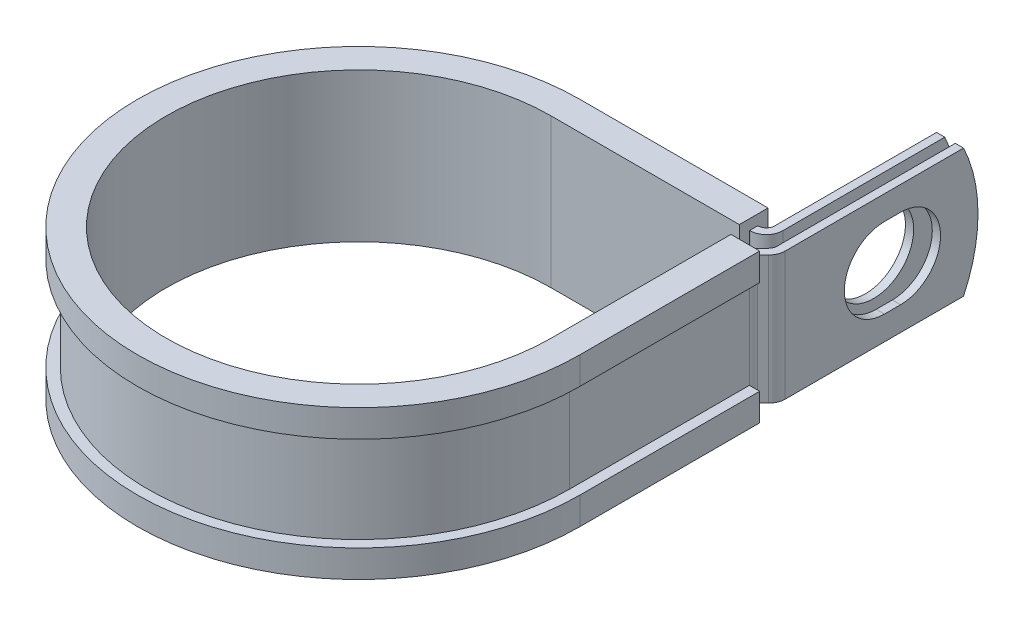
ISO-10303-21;
HEADER;
FILE_DESCRIPTION(('STEP AP214'),'2;1');
FILE_NAME('part.step','',(''),(''),'','','');
FILE_SCHEMA(('AUTOMOTIVE_DESIGN { 1 0 10303 214 1 1 1 1 }'));
ENDSEC;
DATA;
#1=APPLICATION_CONTEXT('core data for automotive mechanical design processes');
#2=APPLICATION_PROTOCOL_DEFINITION('international standard','automotive_design',2000,#1);
#3=PRODUCT_CONTEXT('',#1,'mechanical');
#4=PRODUCT('Part','Part','',(#3));
#5=PRODUCT_RELATED_PRODUCT_CATEGORY('part','',(#4));
#6=PRODUCT_DEFINITION_FORMATION('','',#4);
#7=PRODUCT_DEFINITION_CONTEXT('part definition',#1,'design');
#8=PRODUCT_DEFINITION('design','',#6,#7);
#9=PRODUCT_DEFINITION_SHAPE('','',#8);
#10=(LENGTH_UNIT() NAMED_UNIT(*) SI_UNIT(.MILLI.,.METRE.));
#11=(NAMED_UNIT(*) PLANE_ANGLE_UNIT() SI_UNIT($,.RADIAN.));
#12=(NAMED_UNIT(*) SI_UNIT($,.STERADIAN.) SOLID_ANGLE_UNIT());
#13=UNCERTAINTY_MEASURE_WITH_UNIT(LENGTH_MEASURE(1.E-05),#10,'distance_accuracy_value','');
#14=(GEOMETRIC_REPRESENTATION_CONTEXT(3) GLOBAL_UNCERTAINTY_ASSIGNED_CONTEXT((#13)) GLOBAL_UNIT_ASSIGNED_CONTEXT((#10,
#11,#12)) REPRESENTATION_CONTEXT('',''));
#15=CARTESIAN_POINT('',(0.,0.,0.));
#16=DIRECTION('',(0.,0.,1.));
#17=DIRECTION('',(1.,0.,0.));
#18=AXIS2_PLACEMENT_3D('',#15,#16,#17);
#19=CARTESIAN_POINT('',(30.7772698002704,-9.525,-30.099));
#20=DIRECTION('',(0.,1.,0.));
#21=DIRECTION('',(1.,0.,0.));
#22=AXIS2_PLACEMENT_3D('',#19,#20,#21);
#23=PLANE('',#22);
#24=DIRECTION('',(0.,0.,-1.));
#25=VECTOR('',#24,1.);
#26=CARTESIAN_POINT('',(27.9324698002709,-9.525,-30.099));
#27=LINE('',#26,#25);
#28=CARTESIAN_POINT('',(27.9324698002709,-9.525,-30.099));
#29=VERTEX_POINT('',#28);
#30=CARTESIAN_POINT('',(27.9324698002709,-9.525,-31.3182));
#31=VERTEX_POINT('',#30);
#32=EDGE_CURVE('E523',#29,#31,#27,.T.);
#33=ORIENTED_EDGE('',*,*,#32,.T.);
#34=DIRECTION('',(1.,0.,0.));
#35=VECTOR('',#34,1.);
#36=CARTESIAN_POINT('',(0.,-9.525,-31.3182));
#37=LINE('',#36,#35);
#38=CARTESIAN_POINT('',(27.9832698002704,-9.525,-31.3182));
#39=VERTEX_POINT('',#38);
#40=EDGE_CURVE('E410',#39,#31,#37,.F.);
#41=ORIENTED_EDGE('',*,*,#40,.F.);
#42=CARTESIAN_POINT('',(27.9832698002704,-9.525,-32.5374));
#43=DIRECTION('',(0.,1.,0.));
#44=DIRECTION('',(1.,0.,0.));
#45=AXIS2_PLACEMENT_3D('',#42,#43,#44);
#46=CIRCLE('',#45,1.2192);
#47=CARTESIAN_POINT('',(29.2024698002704,-9.525,-32.5374));
#48=VERTEX_POINT('',#47);
#49=EDGE_CURVE('E408',#48,#39,#46,.F.);
#50=ORIENTED_EDGE('',*,*,#49,.F.);
#51=DIRECTION('',(0.,0.,1.));
#52=VECTOR('',#51,1.);
#53=CARTESIAN_POINT('',(29.2024698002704,-9.525,-58.7248));
#54=LINE('',#53,#52);
#55=CARTESIAN_POINT('',(29.2024698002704,-9.525,-56.5802631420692));
#56=VERTEX_POINT('',#55);
#57=EDGE_CURVE('E406',#56,#48,#54,.T.);
#58=ORIENTED_EDGE('',*,*,#57,.F.);
#59=DIRECTION('',(-1.,0.,0.));
#60=VECTOR('',#59,1.);
#61=CARTESIAN_POINT('',(33.2156698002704,-9.525,-56.5802631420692));
#62=LINE('',#61,#60);
#63=CARTESIAN_POINT('',(30.4216698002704,-9.525,-56.5802631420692));
#64=VERTEX_POINT('',#63);
#65=EDGE_CURVE('E12',#64,#56,#62,.T.);
#66=ORIENTED_EDGE('',*,*,#65,.F.);
#67=DIRECTION('',(0.,0.,1.));
#68=VECTOR('',#67,1.);
#69=CARTESIAN_POINT('',(30.4216698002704,-9.525,-58.7248));
#70=LINE('',#69,#68);
#71=CARTESIAN_POINT('',(30.4216698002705,-9.525,-32.5374));
#72=VERTEX_POINT('',#71);
#73=EDGE_CURVE('E404',#64,#72,#70,.T.);
#74=ORIENTED_EDGE('',*,*,#73,.T.);
#75=CARTESIAN_POINT('',(27.9832698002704,-9.525,-32.5374));
#76=DIRECTION('',(0.,-1.,0.));
#77=DIRECTION('',(0.,0.,1.));
#78=AXIS2_PLACEMENT_3D('',#75,#76,#77);
#79=CIRCLE('',#78,2.4384);
#80=CARTESIAN_POINT('',(27.9832698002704,-9.525,-30.099));
#81=VERTEX_POINT('',#80);
#82=EDGE_CURVE('E401',#72,#81,#79,.T.);
#83=ORIENTED_EDGE('',*,*,#82,.T.);
#84=DIRECTION('',(-1.,0.,0.));
#85=VECTOR('',#84,1.);
#86=CARTESIAN_POINT('',(0.,-9.525,-30.099));
#87=LINE('',#86,#85);
#88=EDGE_CURVE('E398',#81,#29,#87,.T.);
#89=ORIENTED_EDGE('',*,*,#88,.T.);
#90=EDGE_LOOP('',(#33,#41,#50,#58,#66,#74,#83,#89));
#91=FACE_BOUND('',#90,.T.);
#92=ADVANCED_FACE('F54',(#91),#23,.F.);
#93=CARTESIAN_POINT('',(30.7772698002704,9.525,-30.099));
#94=DIRECTION('',(0.,1.,0.));
#95=DIRECTION('',(1.,0.,0.));
#96=AXIS2_PLACEMENT_3D('',#93,#94,#95);
#97=PLANE('',#96);
#98=DIRECTION('',(1.,0.,0.));
#99=VECTOR('',#98,1.);
#100=CARTESIAN_POINT('',(0.,9.525,-31.3182));
#101=LINE('',#100,#99);
#102=CARTESIAN_POINT('',(27.9832698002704,9.525,-31.3182));
#103=VERTEX_POINT('',#102);
#104=CARTESIAN_POINT('',(27.9324698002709,9.525,-31.3182));
#105=VERTEX_POINT('',#104);
#106=EDGE_CURVE('E368',#103,#105,#101,.F.);
#107=ORIENTED_EDGE('',*,*,#106,.T.);
#108=DIRECTION('',(0.,0.,1.));
#109=VECTOR('',#108,1.);
#110=CARTESIAN_POINT('',(27.9324698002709,9.525,-31.3182));
#111=LINE('',#110,#109);
#112=CARTESIAN_POINT('',(27.9324698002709,9.525,-30.099));
#113=VERTEX_POINT('',#112);
#114=EDGE_CURVE('E517',#105,#113,#111,.T.);
#115=ORIENTED_EDGE('',*,*,#114,.T.);
#116=DIRECTION('',(-1.,0.,0.));
#117=VECTOR('',#116,1.);
#118=CARTESIAN_POINT('',(0.,9.525,-30.099));
#119=LINE('',#118,#117);
#120=CARTESIAN_POINT('',(27.9832698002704,9.525,-30.099));
#121=VERTEX_POINT('',#120);
#122=EDGE_CURVE('E625',#121,#113,#119,.T.);
#123=ORIENTED_EDGE('',*,*,#122,.F.);
#124=CARTESIAN_POINT('',(27.9832698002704,9.525,-32.5374));
#125=DIRECTION('',(0.,-1.,0.));
#126=DIRECTION('',(0.,0.,1.));
#127=AXIS2_PLACEMENT_3D('',#124,#125,#126);
#128=CIRCLE('',#127,2.4384);
#129=CARTESIAN_POINT('',(30.4216698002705,9.525,-32.5374));
#130=VERTEX_POINT('',#129);
#131=EDGE_CURVE('E370',#130,#121,#128,.T.);
#132=ORIENTED_EDGE('',*,*,#131,.F.);
#133=DIRECTION('',(0.,0.,1.));
#134=VECTOR('',#133,1.);
#135=CARTESIAN_POINT('',(30.4216698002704,9.525,-58.7248));
#136=LINE('',#135,#134);
#137=CARTESIAN_POINT('',(30.4216698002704,9.525,-56.5802631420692));
#138=VERTEX_POINT('',#137);
#139=EDGE_CURVE('E361',#138,#130,#136,.T.);
#140=ORIENTED_EDGE('',*,*,#139,.F.);
#141=DIRECTION('',(-1.,0.,0.));
#142=VECTOR('',#141,1.);
#143=CARTESIAN_POINT('',(33.2156698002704,9.525,-56.5802631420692));
#144=LINE('',#143,#142);
#145=CARTESIAN_POINT('',(29.2024698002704,9.525,-56.5802631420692));
#146=VERTEX_POINT('',#145);
#147=EDGE_CURVE('E62',#138,#146,#144,.T.);
#148=ORIENTED_EDGE('',*,*,#147,.T.);
#149=DIRECTION('',(0.,0.,1.));
#150=VECTOR('',#149,1.);
#151=CARTESIAN_POINT('',(29.2024698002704,9.525,-58.7248));
#152=LINE('',#151,#150);
#153=CARTESIAN_POINT('',(29.2024698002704,9.525,-32.5374));
#154=VERTEX_POINT('',#153);
#155=EDGE_CURVE('E358',#146,#154,#152,.T.);
#156=ORIENTED_EDGE('',*,*,#155,.T.);
#157=CARTESIAN_POINT('',(27.9832698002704,9.525,-32.5374));
#158=DIRECTION('',(0.,1.,0.));
#159=DIRECTION('',(1.,0.,0.));
#160=AXIS2_PLACEMENT_3D('',#157,#158,#159);
#161=CIRCLE('',#160,1.2192);
#162=EDGE_CURVE('E366',#154,#103,#161,.F.);
#163=ORIENTED_EDGE('',*,*,#162,.T.);
#164=EDGE_LOOP('',(#107,#115,#123,#132,#140,#148,#156,#163));
#165=FACE_BOUND('',#164,.T.);
#166=ADVANCED_FACE('F357',(#165),#97,.T.);
#167=CARTESIAN_POINT('',(0.,9.525,-30.099));
#168=DIRECTION('',(0.,0.,1.));
#169=DIRECTION('',(1.,0.,0.));
#170=AXIS2_PLACEMENT_3D('',#167,#168,#169);
#171=PLANE('',#170);
#172=ORIENTED_EDGE('',*,*,#122,.T.);
#173=DIRECTION('',(0.,-1.,0.));
#174=VECTOR('',#173,1.);
#175=CARTESIAN_POINT('',(27.9324698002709,9.525,-30.099));
#176=LINE('',#175,#174);
#177=EDGE_CURVE('E520',#113,#29,#176,.T.);
#178=ORIENTED_EDGE('',*,*,#177,.T.);
#179=ORIENTED_EDGE('',*,*,#88,.F.);
#180=DIRECTION('',(0.,-1.,0.));
#181=VECTOR('',#180,1.);
#182=CARTESIAN_POINT('',(27.9832698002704,9.525,-30.099));
#183=LINE('',#182,#181);
#184=EDGE_CURVE('E344',#121,#81,#183,.T.);
#185=ORIENTED_EDGE('',*,*,#184,.F.);
#186=EDGE_LOOP('',(#172,#178,#179,#185));
#187=FACE_BOUND('',#186,.T.);
#188=ADVANCED_FACE('F635',(#187),#171,.T.);
#189=CARTESIAN_POINT('',(33.2156698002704,9.525,-30.099));
#190=DIRECTION('',(-1.,0.,0.));
#191=DIRECTION('',(0.,0.,1.));
#192=AXIS2_PLACEMENT_3D('',#189,#190,#191);
#193=PLANE('',#192);
#194=CARTESIAN_POINT('',(33.2156698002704,0.,-47.2185999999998));
#195=DIRECTION('',(1.,0.,0.));
#196=DIRECTION('',(0.,0.,-1.));
#197=AXIS2_PLACEMENT_3D('',#194,#195,#196);
#198=CIRCLE('',#197,5.9436);
#199=CARTESIAN_POINT('',(33.2156698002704,-5.9436,-47.2186000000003));
#200=VERTEX_POINT('',#199);
#201=CARTESIAN_POINT('',(33.2156698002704,5.9436,-47.2186000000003));
#202=VERTEX_POINT('',#201);
#203=EDGE_CURVE('E580',#200,#202,#198,.T.);
#204=ORIENTED_EDGE('',*,*,#203,.F.);
#205=DIRECTION('',(0.,0.,-1.));
#206=VECTOR('',#205,1.);
#207=CARTESIAN_POINT('',(33.2156698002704,-5.9436,-44.8309999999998));
#208=LINE('',#207,#206);
#209=CARTESIAN_POINT('',(33.2156698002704,-5.9436,-44.8309999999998));
#210=VERTEX_POINT('',#209);
#211=EDGE_CURVE('E583',#210,#200,#208,.T.);
#212=ORIENTED_EDGE('',*,*,#211,.F.);
#213=CARTESIAN_POINT('',(33.2156698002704,0.,-44.8309999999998));
#214=DIRECTION('',(1.,0.,0.));
#215=DIRECTION('',(0.,0.,-1.));
#216=AXIS2_PLACEMENT_3D('',#213,#214,#215);
#217=CIRCLE('',#216,5.9436);
#218=CARTESIAN_POINT('',(33.2156698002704,5.9436,-44.8309999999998));
#219=VERTEX_POINT('',#218);
#220=EDGE_CURVE('E576',#219,#210,#217,.T.);
#221=ORIENTED_EDGE('',*,*,#220,.F.);
#222=DIRECTION('',(0.,0.,1.));
#223=VECTOR('',#222,1.);
#224=CARTESIAN_POINT('',(33.2156698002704,5.9436,-44.8309999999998));
#225=LINE('',#224,#223);
#226=EDGE_CURVE('E577',#202,#219,#225,.T.);
#227=ORIENTED_EDGE('',*,*,#226,.F.);
#228=EDGE_LOOP('',(#204,#212,#221,#227));
#229=FACE_BOUND('',#228,.T.);
#230=DIRECTION('',(0.,0.,-1.));
#231=VECTOR('',#230,1.);
#232=CARTESIAN_POINT('',(33.2156698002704,-9.525,-30.099));
#233=LINE('',#232,#231);
#234=CARTESIAN_POINT('',(33.2156698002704,-9.525,-30.099));
#235=VERTEX_POINT('',#234);
#236=CARTESIAN_POINT('',(33.2156698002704,-9.525,-56.5802631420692));
#237=VERTEX_POINT('',#236);
#238=EDGE_CURVE('E382',#235,#237,#233,.T.);
#239=ORIENTED_EDGE('',*,*,#238,.T.);
#240=CARTESIAN_POINT('',(33.2156698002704,0.,-36.4998));
#241=DIRECTION('',(-1.,0.,0.));
#242=DIRECTION('',(0.,0.,1.));
#243=AXIS2_PLACEMENT_3D('',#240,#241,#242);
#244=CIRCLE('',#243,22.225);
#245=CARTESIAN_POINT('',(33.2156698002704,9.525,-56.5802631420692));
#246=VERTEX_POINT('',#245);
#247=EDGE_CURVE('E568',#246,#237,#244,.T.);
#248=ORIENTED_EDGE('',*,*,#247,.F.);
#249=DIRECTION('',(0.,0.,-1.));
#250=VECTOR('',#249,1.);
#251=CARTESIAN_POINT('',(33.2156698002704,9.525,-30.099));
#252=LINE('',#251,#250);
#253=CARTESIAN_POINT('',(33.2156698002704,9.525,-30.099));
#254=VERTEX_POINT('',#253);
#255=EDGE_CURVE('E419',#254,#246,#252,.T.);
#256=ORIENTED_EDGE('',*,*,#255,.F.);
#257=DIRECTION('',(0.,-1.,0.));
#258=VECTOR('',#257,1.);
#259=CARTESIAN_POINT('',(33.2156698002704,9.525,-30.099));
#260=LINE('',#259,#258);
#261=EDGE_CURVE('E381',#254,#235,#260,.T.);
#262=ORIENTED_EDGE('',*,*,#261,.T.);
#263=EDGE_LOOP('',(#239,#248,#256,#262));
#264=FACE_BOUND('',#263,.T.);
#265=ADVANCED_FACE('F56',(#229,#264),#193,.F.);
#266=CARTESIAN_POINT('',(31.9964698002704,9.525,-30.099));
#267=DIRECTION('',(-1.,0.,0.));
#268=DIRECTION('',(0.,0.,1.));
#269=AXIS2_PLACEMENT_3D('',#266,#267,#268);
#270=PLANE('',#269);
#271=DIRECTION('',(0.,0.,-1.));
#272=VECTOR('',#271,1.);
#273=CARTESIAN_POINT('',(31.9964698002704,-5.9436,-44.8309999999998));
#274=LINE('',#273,#272);
#275=CARTESIAN_POINT('',(31.9964698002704,-5.9436,-44.8309999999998));
#276=VERTEX_POINT('',#275);
#277=CARTESIAN_POINT('',(31.9964698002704,-5.9436,-47.2186000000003));
#278=VERTEX_POINT('',#277);
#279=EDGE_CURVE('E579',#276,#278,#274,.T.);
#280=ORIENTED_EDGE('',*,*,#279,.T.);
#281=CARTESIAN_POINT('',(31.9964698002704,0.,-47.2185999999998));
#282=DIRECTION('',(-1.,0.,0.));
#283=DIRECTION('',(0.,0.,1.));
#284=AXIS2_PLACEMENT_3D('',#281,#282,#283);
#285=CIRCLE('',#284,5.9436);
#286=CARTESIAN_POINT('',(31.9964698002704,5.9436,-47.2186000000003));
#287=VERTEX_POINT('',#286);
#288=EDGE_CURVE('E600',#278,#287,#285,.F.);
#289=ORIENTED_EDGE('',*,*,#288,.T.);
#290=DIRECTION('',(0.,0.,1.));
#291=VECTOR('',#290,1.);
#292=CARTESIAN_POINT('',(31.9964698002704,5.9436,-44.8309999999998));
#293=LINE('',#292,#291);
#294=CARTESIAN_POINT('',(31.9964698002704,5.9436,-44.8309999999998));
#295=VERTEX_POINT('',#294);
#296=EDGE_CURVE('E596',#287,#295,#293,.T.);
#297=ORIENTED_EDGE('',*,*,#296,.T.);
#298=CARTESIAN_POINT('',(31.9964698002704,0.,-44.8309999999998));
#299=DIRECTION('',(-1.,0.,0.));
#300=DIRECTION('',(0.,0.,1.));
#301=AXIS2_PLACEMENT_3D('',#298,#299,#300);
#302=CIRCLE('',#301,5.9436);
#303=EDGE_CURVE('E591',#295,#276,#302,.F.);
#304=ORIENTED_EDGE('',*,*,#303,.T.);
#305=EDGE_LOOP('',(#280,#289,#297,#304));
#306=FACE_BOUND('',#305,.T.);
#307=CARTESIAN_POINT('',(31.9964698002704,0.,-36.4998));
#308=DIRECTION('',(-1.,0.,0.));
#309=DIRECTION('',(0.,0.,1.));
#310=AXIS2_PLACEMENT_3D('',#307,#308,#309);
#311=CIRCLE('',#310,22.225);
#312=CARTESIAN_POINT('',(31.9964698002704,9.525,-56.5802631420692));
#313=VERTEX_POINT('',#312);
#314=CARTESIAN_POINT('',(31.9964698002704,-9.525,-56.5802631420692));
#315=VERTEX_POINT('',#314);
#316=EDGE_CURVE('E76',#313,#315,#311,.T.);
#317=ORIENTED_EDGE('',*,*,#316,.T.);
#318=DIRECTION('',(0.,0.,-1.));
#319=VECTOR('',#318,1.);
#320=CARTESIAN_POINT('',(31.9964698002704,-9.525,-30.099));
#321=LINE('',#320,#319);
#322=CARTESIAN_POINT('',(31.9964698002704,-9.525,-30.099));
#323=VERTEX_POINT('',#322);
#324=EDGE_CURVE('E385',#323,#315,#321,.T.);
#325=ORIENTED_EDGE('',*,*,#324,.F.);
#326=DIRECTION('',(0.,-1.,0.));
#327=VECTOR('',#326,1.);
#328=CARTESIAN_POINT('',(31.9964698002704,9.525,-30.099));
#329=LINE('',#328,#327);
#330=CARTESIAN_POINT('',(31.9964698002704,9.525,-30.099));
#331=VERTEX_POINT('',#330);
#332=EDGE_CURVE('E352',#331,#323,#329,.T.);
#333=ORIENTED_EDGE('',*,*,#332,.F.);
#334=DIRECTION('',(0.,0.,-1.));
#335=VECTOR('',#334,1.);
#336=CARTESIAN_POINT('',(31.9964698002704,9.525,-30.099));
#337=LINE('',#336,#335);
#338=EDGE_CURVE('E615',#331,#313,#337,.T.);
#339=ORIENTED_EDGE('',*,*,#338,.T.);
#340=EDGE_LOOP('',(#317,#325,#333,#339));
#341=FACE_BOUND('',#340,.T.);
#342=ADVANCED_FACE('F689',(#306,#341),#270,.T.);
#343=CARTESIAN_POINT('',(30.4216698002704,9.525,-58.7248));
#344=DIRECTION('',(1.,0.,0.));
#345=DIRECTION('',(0.,0.,-1.));
#346=AXIS2_PLACEMENT_3D('',#343,#344,#345);
#347=PLANE('',#346);
#348=CARTESIAN_POINT('',(30.4216698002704,0.,-46.0248));
#349=DIRECTION('',(1.,0.,0.));
#350=DIRECTION('',(0.,0.,-1.));
#351=AXIS2_PLACEMENT_3D('',#348,#349,#350);
#352=CIRCLE('',#351,5.9436);
#353=CARTESIAN_POINT('',(30.4216698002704,0.,-51.9684));
#354=VERTEX_POINT('',#353);
#355=EDGE_CURVE('E386',#354,#354,#352,.F.);
#356=ORIENTED_EDGE('',*,*,#355,.T.);
#357=EDGE_LOOP('',(#356));
#358=FACE_BOUND('',#357,.T.);
#359=ORIENTED_EDGE('',*,*,#73,.F.);
#360=CARTESIAN_POINT('',(30.4216698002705,0.,-36.4998));
#361=DIRECTION('',(1.,0.,0.));
#362=DIRECTION('',(0.,0.,-1.));
#363=AXIS2_PLACEMENT_3D('',#360,#361,#362);
#364=CIRCLE('',#363,22.225);
#365=EDGE_CURVE('E573',#64,#138,#364,.T.);
#366=ORIENTED_EDGE('',*,*,#365,.T.);
#367=ORIENTED_EDGE('',*,*,#139,.T.);
#368=DIRECTION('',(0.,-1.,0.));
#369=VECTOR('',#368,1.);
#370=CARTESIAN_POINT('',(30.4216698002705,9.525,-32.5374));
#371=LINE('',#370,#369);
#372=EDGE_CURVE('E341',#130,#72,#371,.T.);
#373=ORIENTED_EDGE('',*,*,#372,.T.);
#374=EDGE_LOOP('',(#359,#366,#367,#373));
#375=FACE_BOUND('',#374,.T.);
#376=ADVANCED_FACE('F641',(#358,#375),#347,.T.);
#377=CARTESIAN_POINT('',(29.2024698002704,9.525,-58.7248));
#378=DIRECTION('',(1.,0.,0.));
#379=DIRECTION('',(0.,0.,-1.));
#380=AXIS2_PLACEMENT_3D('',#377,#378,#379);
#381=PLANE('',#380);
#382=CARTESIAN_POINT('',(29.2024698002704,0.,-46.0248));
#383=DIRECTION('',(-1.,0.,0.));
#384=DIRECTION('',(0.,0.,1.));
#385=AXIS2_PLACEMENT_3D('',#382,#383,#384);
#386=CIRCLE('',#385,5.9436);
#387=CARTESIAN_POINT('',(29.2024698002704,0.,-40.0812));
#388=VERTEX_POINT('',#387);
#389=EDGE_CURVE('E608',#388,#388,#386,.T.);
#390=ORIENTED_EDGE('',*,*,#389,.F.);
#391=EDGE_LOOP('',(#390));
#392=FACE_BOUND('',#391,.T.);
#393=CARTESIAN_POINT('',(29.2024698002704,0.,-36.4998));
#394=DIRECTION('',(-1.,0.,0.));
#395=DIRECTION('',(0.,0.,1.));
#396=AXIS2_PLACEMENT_3D('',#393,#394,#395);
#397=CIRCLE('',#396,22.225);
#398=EDGE_CURVE('E68',#146,#56,#397,.T.);
#399=ORIENTED_EDGE('',*,*,#398,.T.);
#400=ORIENTED_EDGE('',*,*,#57,.T.);
#401=DIRECTION('',(0.,-1.,0.));
#402=VECTOR('',#401,1.);
#403=CARTESIAN_POINT('',(29.2024698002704,9.525,-32.5374));
#404=LINE('',#403,#402);
#405=EDGE_CURVE('E338',#154,#48,#404,.T.);
#406=ORIENTED_EDGE('',*,*,#405,.F.);
#407=ORIENTED_EDGE('',*,*,#155,.F.);
#408=EDGE_LOOP('',(#399,#400,#406,#407));
#409=FACE_BOUND('',#408,.T.);
#410=ADVANCED_FACE('F364',(#392,#409),#381,.F.);
#411=CARTESIAN_POINT('',(32.5374,-9.525,-26.6865026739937));
#412=DIRECTION('',(0.,1.,0.));
#413=DIRECTION('',(1.,0.,0.));
#414=AXIS2_PLACEMENT_3D('',#411,#412,#413);
#415=CIRCLE('',#414,1.21920000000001);
#416=CARTESIAN_POINT('',(31.3182,-9.525,-26.6865026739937));
#417=VERTEX_POINT('',#416);
#418=CARTESIAN_POINT('',(31.6752954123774,-9.525,-27.5486072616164));
#419=VERTEX_POINT('',#418);
#420=EDGE_CURVE('E413',#417,#419,#415,.F.);
#421=ORIENTED_EDGE('',*,*,#420,.F.);
#422=DIRECTION('',(1.,0.,0.));
#423=VECTOR('',#422,1.);
#424=CARTESIAN_POINT('',(30.099,-9.525,-26.6865026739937));
#425=LINE('',#424,#423);
#426=CARTESIAN_POINT('',(30.099,-9.525,-26.6865026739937));
#427=VERTEX_POINT('',#426);
#428=EDGE_CURVE('E451',#427,#417,#425,.T.);
#429=ORIENTED_EDGE('',*,*,#428,.F.);
#430=CARTESIAN_POINT('',(32.5374,-9.525,-26.6865026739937));
#431=DIRECTION('',(0.,-1.,0.));
#432=DIRECTION('',(0.,0.,1.));
#433=AXIS2_PLACEMENT_3D('',#430,#431,#432);
#434=CIRCLE('',#433,2.43840000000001);
#435=CARTESIAN_POINT('',(30.8131908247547,-9.525,-28.410711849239));
#436=VERTEX_POINT('',#435);
#437=EDGE_CURVE('E395',#427,#436,#434,.T.);
#438=ORIENTED_EDGE('',*,*,#437,.T.);
#439=DIRECTION('',(0.707106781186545,0.,-0.70710678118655));
#440=VECTOR('',#439,1.);
#441=CARTESIAN_POINT('',(30.8131908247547,-9.525,-28.410711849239));
#442=LINE('',#441,#440);
#443=CARTESIAN_POINT('',(31.6393743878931,-9.525,-29.2368954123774));
#444=VERTEX_POINT('',#443);
#445=EDGE_CURVE('E392',#436,#444,#442,.T.);
#446=ORIENTED_EDGE('',*,*,#445,.T.);
#447=CARTESIAN_POINT('',(30.7772698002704,-9.525,-30.099));
#448=DIRECTION('',(0.,1.,0.));
#449=DIRECTION('',(0.,0.,1.));
#450=AXIS2_PLACEMENT_3D('',#447,#448,#449);
#451=CIRCLE('',#450,1.2192);
#452=EDGE_CURVE('E389',#444,#323,#451,.T.);
#453=ORIENTED_EDGE('',*,*,#452,.T.);
#454=ORIENTED_EDGE('',*,*,#324,.T.);
#455=DIRECTION('',(-1.,0.,0.));
#456=VECTOR('',#455,1.);
#457=CARTESIAN_POINT('',(33.2156698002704,-9.525,-56.5802631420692));
#458=LINE('',#457,#456);
#459=EDGE_CURVE('E566',#237,#315,#458,.T.);
#460=ORIENTED_EDGE('',*,*,#459,.F.);
#461=ORIENTED_EDGE('',*,*,#238,.F.);
#462=CARTESIAN_POINT('',(30.7772698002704,-9.525,-30.099));
#463=DIRECTION('',(0.,1.,0.));
#464=DIRECTION('',(1.,0.,0.));
#465=AXIS2_PLACEMENT_3D('',#462,#463,#464);
#466=CIRCLE('',#465,2.4384);
#467=CARTESIAN_POINT('',(32.5014789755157,-9.525,-28.3747908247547));
#468=VERTEX_POINT('',#467);
#469=EDGE_CURVE('E417',#468,#235,#466,.T.);
#470=ORIENTED_EDGE('',*,*,#469,.F.);
#471=DIRECTION('',(0.707106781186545,0.,-0.70710678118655));
#472=VECTOR('',#471,1.);
#473=CARTESIAN_POINT('',(31.6752954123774,-9.525,-27.5486072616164));
#474=LINE('',#473,#472);
#475=EDGE_CURVE('E415',#419,#468,#474,.T.);
#476=ORIENTED_EDGE('',*,*,#475,.F.);
#477=EDGE_LOOP('',(#421,#429,#438,#446,#453,#454,#460,#461,#470,#476));
#478=FACE_BOUND('',#477,.T.);
#479=ADVANCED_FACE('F675',(#478),#23,.F.);
#480=DIRECTION('',(-1.,0.,0.));
#481=VECTOR('',#480,1.);
#482=CARTESIAN_POINT('',(31.3182,9.525,-26.6865026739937));
#483=LINE('',#482,#481);
#484=CARTESIAN_POINT('',(31.3182,9.525,-26.6865026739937));
#485=VERTEX_POINT('',#484);
#486=CARTESIAN_POINT('',(30.099,9.525,-26.6865026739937));
#487=VERTEX_POINT('',#486);
#488=EDGE_CURVE('E440',#485,#487,#483,.T.);
#489=ORIENTED_EDGE('',*,*,#488,.F.);
#490=CARTESIAN_POINT('',(32.5374,9.525,-26.6865026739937));
#491=DIRECTION('',(0.,1.,0.));
#492=DIRECTION('',(1.,0.,0.));
#493=AXIS2_PLACEMENT_3D('',#490,#491,#492);
#494=CIRCLE('',#493,1.21920000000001);
#495=CARTESIAN_POINT('',(31.6752954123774,9.525,-27.5486072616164));
#496=VERTEX_POINT('',#495);
#497=EDGE_CURVE('E375',#485,#496,#494,.F.);
#498=ORIENTED_EDGE('',*,*,#497,.T.);
#499=DIRECTION('',(0.707106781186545,0.,-0.70710678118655));
#500=VECTOR('',#499,1.);
#501=CARTESIAN_POINT('',(31.6752954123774,9.525,-27.5486072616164));
#502=LINE('',#501,#500);
#503=CARTESIAN_POINT('',(32.5014789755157,9.525,-28.3747908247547));
#504=VERTEX_POINT('',#503);
#505=EDGE_CURVE('E377',#496,#504,#502,.T.);
#506=ORIENTED_EDGE('',*,*,#505,.T.);
#507=CARTESIAN_POINT('',(30.7772698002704,9.525,-30.099));
#508=DIRECTION('',(0.,1.,0.));
#509=DIRECTION('',(1.,0.,0.));
#510=AXIS2_PLACEMENT_3D('',#507,#508,#509);
#511=CIRCLE('',#510,2.4384);
#512=EDGE_CURVE('E379',#504,#254,#511,.T.);
#513=ORIENTED_EDGE('',*,*,#512,.T.);
#514=ORIENTED_EDGE('',*,*,#255,.T.);
#515=DIRECTION('',(-1.,0.,0.));
#516=VECTOR('',#515,1.);
#517=CARTESIAN_POINT('',(33.2156698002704,9.525,-56.5802631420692));
#518=LINE('',#517,#516);
#519=EDGE_CURVE('E570',#246,#313,#518,.T.);
#520=ORIENTED_EDGE('',*,*,#519,.T.);
#521=ORIENTED_EDGE('',*,*,#338,.F.);
#522=CARTESIAN_POINT('',(30.7772698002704,9.525,-30.099));
#523=DIRECTION('',(0.,1.,0.));
#524=DIRECTION('',(0.,0.,1.));
#525=AXIS2_PLACEMENT_3D('',#522,#523,#524);
#526=CIRCLE('',#525,1.2192);
#527=CARTESIAN_POINT('',(31.6393743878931,9.525,-29.2368954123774));
#528=VERTEX_POINT('',#527);
#529=EDGE_CURVE('E618',#528,#331,#526,.T.);
#530=ORIENTED_EDGE('',*,*,#529,.F.);
#531=DIRECTION('',(0.707106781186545,0.,-0.70710678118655));
#532=VECTOR('',#531,1.);
#533=CARTESIAN_POINT('',(30.8131908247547,9.525,-28.410711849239));
#534=LINE('',#533,#532);
#535=CARTESIAN_POINT('',(30.8131908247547,9.525,-28.410711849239));
#536=VERTEX_POINT('',#535);
#537=EDGE_CURVE('E621',#536,#528,#534,.T.);
#538=ORIENTED_EDGE('',*,*,#537,.F.);
#539=CARTESIAN_POINT('',(32.5374,9.525,-26.6865026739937));
#540=DIRECTION('',(0.,-1.,0.));
#541=DIRECTION('',(0.,0.,1.));
#542=AXIS2_PLACEMENT_3D('',#539,#540,#541);
#543=CIRCLE('',#542,2.43840000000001);
#544=EDGE_CURVE('E450',#487,#536,#543,.T.);
#545=ORIENTED_EDGE('',*,*,#544,.F.);
#546=EDGE_LOOP('',(#489,#498,#506,#513,#514,#520,#521,#530,#538,#545));
#547=FACE_BOUND('',#546,.T.);
#548=ADVANCED_FACE('F447',(#547),#97,.T.);
#549=CARTESIAN_POINT('',(30.7772698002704,9.525,-30.099));
#550=DIRECTION('',(0.,-1.,0.));
#551=DIRECTION('',(0.,0.,-1.));
#552=AXIS2_PLACEMENT_3D('',#549,#550,#551);
#553=CYLINDRICAL_SURFACE('',#552,1.2192);
#554=ORIENTED_EDGE('',*,*,#452,.F.);
#555=DIRECTION('',(0.,-1.,0.));
#556=VECTOR('',#555,1.);
#557=CARTESIAN_POINT('',(31.6393743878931,9.525,-29.2368954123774));
#558=LINE('',#557,#556);
#559=EDGE_CURVE('E350',#528,#444,#558,.T.);
#560=ORIENTED_EDGE('',*,*,#559,.F.);
#561=ORIENTED_EDGE('',*,*,#529,.T.);
#562=ORIENTED_EDGE('',*,*,#332,.T.);
#563=EDGE_LOOP('',(#554,#560,#561,#562));
#564=FACE_BOUND('',#563,.T.);
#565=ADVANCED_FACE('F685',(#564),#553,.F.);
#566=CARTESIAN_POINT('',(30.8131908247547,9.525,-28.410711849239));
#567=DIRECTION('',(-0.70710678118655,0.,-0.707106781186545));
#568=DIRECTION('',(-0.707106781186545,0.,0.70710678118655));
#569=AXIS2_PLACEMENT_3D('',#566,#567,#568);
#570=PLANE('',#569);
#571=ORIENTED_EDGE('',*,*,#445,.F.);
#572=DIRECTION('',(0.,-1.,0.));
#573=VECTOR('',#572,1.);
#574=CARTESIAN_POINT('',(30.8131908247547,9.525,-28.410711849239));
#575=LINE('',#574,#573);
#576=EDGE_CURVE('E348',#536,#436,#575,.T.);
#577=ORIENTED_EDGE('',*,*,#576,.F.);
#578=ORIENTED_EDGE('',*,*,#537,.T.);
#579=ORIENTED_EDGE('',*,*,#559,.T.);
#580=EDGE_LOOP('',(#571,#577,#578,#579));
#581=FACE_BOUND('',#580,.T.);
#582=ADVANCED_FACE('F680',(#581),#570,.T.);
#583=CARTESIAN_POINT('',(32.5374,9.525,-26.6865026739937));
#584=DIRECTION('',(0.,-1.,0.));
#585=DIRECTION('',(0.,0.,-1.));
#586=AXIS2_PLACEMENT_3D('',#583,#584,#585);
#587=CYLINDRICAL_SURFACE('',#586,2.43840000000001);
#588=ORIENTED_EDGE('',*,*,#437,.F.);
#589=DIRECTION('',(0.,-1.,0.));
#590=VECTOR('',#589,1.);
#591=CARTESIAN_POINT('',(30.099,9.525,-26.6865026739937));
#592=LINE('',#591,#590);
#593=EDGE_CURVE('E346',#487,#427,#592,.T.);
#594=ORIENTED_EDGE('',*,*,#593,.F.);
#595=ORIENTED_EDGE('',*,*,#544,.T.);
#596=ORIENTED_EDGE('',*,*,#576,.T.);
#597=EDGE_LOOP('',(#588,#594,#595,#596));
#598=FACE_BOUND('',#597,.T.);
#599=ADVANCED_FACE('F677',(#598),#587,.T.);
#600=CARTESIAN_POINT('',(27.9832698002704,9.525,-32.5374));
#601=DIRECTION('',(0.,-1.,0.));
#602=DIRECTION('',(0.,0.,-1.));
#603=AXIS2_PLACEMENT_3D('',#600,#601,#602);
#604=CYLINDRICAL_SURFACE('',#603,2.4384);
#605=ORIENTED_EDGE('',*,*,#82,.F.);
#606=ORIENTED_EDGE('',*,*,#372,.F.);
#607=ORIENTED_EDGE('',*,*,#131,.T.);
#608=ORIENTED_EDGE('',*,*,#184,.T.);
#609=EDGE_LOOP('',(#605,#606,#607,#608));
#610=FACE_BOUND('',#609,.T.);
#611=ADVANCED_FACE('F631',(#610),#604,.T.);
#612=CARTESIAN_POINT('',(27.9832698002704,9.525,-32.5374));
#613=DIRECTION('',(0.,-1.,0.));
#614=DIRECTION('',(0.,0.,-1.));
#615=AXIS2_PLACEMENT_3D('',#612,#613,#614);
#616=CYLINDRICAL_SURFACE('',#615,1.2192);
#617=ORIENTED_EDGE('',*,*,#49,.T.);
#618=DIRECTION('',(0.,-1.,0.));
#619=VECTOR('',#618,1.);
#620=CARTESIAN_POINT('',(27.9832698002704,9.525,-31.3182));
#621=LINE('',#620,#619);
#622=EDGE_CURVE('E329',#103,#39,#621,.T.);
#623=ORIENTED_EDGE('',*,*,#622,.F.);
#624=ORIENTED_EDGE('',*,*,#162,.F.);
#625=ORIENTED_EDGE('',*,*,#405,.T.);
#626=EDGE_LOOP('',(#617,#623,#624,#625));
#627=FACE_BOUND('',#626,.T.);
#628=ADVANCED_FACE('F646',(#627),#616,.F.);
#629=CARTESIAN_POINT('',(0.,9.525,-31.3182));
#630=DIRECTION('',(0.,0.,1.));
#631=DIRECTION('',(1.,0.,0.));
#632=AXIS2_PLACEMENT_3D('',#629,#630,#631);
#633=PLANE('',#632);
#634=DIRECTION('',(0.,-1.,0.));
#635=VECTOR('',#634,1.);
#636=CARTESIAN_POINT('',(0.,9.525,-31.3182));
#637=LINE('',#636,#635);
#638=CARTESIAN_POINT('',(4.39305330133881E-13,6.985,-31.3182));
#639=VERTEX_POINT('',#638);
#640=CARTESIAN_POINT('',(4.39305330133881E-13,-6.985,-31.3182));
#641=VERTEX_POINT('',#640);
#642=EDGE_CURVE('E320',#639,#641,#637,.T.);
#643=ORIENTED_EDGE('',*,*,#642,.F.);
#644=DIRECTION('',(1.,0.,0.));
#645=VECTOR('',#644,1.);
#646=CARTESIAN_POINT('',(4.39305330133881E-13,6.985,-31.3182));
#647=LINE('',#646,#645);
#648=CARTESIAN_POINT('',(27.9324698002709,6.985,-31.3182));
#649=VERTEX_POINT('',#648);
#650=EDGE_CURVE('E563',#639,#649,#647,.T.);
#651=ORIENTED_EDGE('',*,*,#650,.T.);
#652=DIRECTION('',(0.,1.,0.));
#653=VECTOR('',#652,1.);
#654=CARTESIAN_POINT('',(27.9324698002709,9.525,-31.3182));
#655=LINE('',#654,#653);
#656=EDGE_CURVE('E514',#649,#105,#655,.T.);
#657=ORIENTED_EDGE('',*,*,#656,.T.);
#658=ORIENTED_EDGE('',*,*,#106,.F.);
#659=ORIENTED_EDGE('',*,*,#622,.T.);
#660=ORIENTED_EDGE('',*,*,#40,.T.);
#661=DIRECTION('',(0.,1.,0.));
#662=VECTOR('',#661,1.);
#663=CARTESIAN_POINT('',(27.9324698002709,-9.525,-31.3182));
#664=LINE('',#663,#662);
#665=CARTESIAN_POINT('',(27.9324698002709,-6.985,-31.3182));
#666=VERTEX_POINT('',#665);
#667=EDGE_CURVE('E526',#31,#666,#664,.T.);
#668=ORIENTED_EDGE('',*,*,#667,.T.);
#669=DIRECTION('',(1.,0.,0.));
#670=VECTOR('',#669,1.);
#671=CARTESIAN_POINT('',(4.39305330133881E-13,-6.985,-31.3182));
#672=LINE('',#671,#670);
#673=EDGE_CURVE('E543',#641,#666,#672,.T.);
#674=ORIENTED_EDGE('',*,*,#673,.F.);
#675=EDGE_LOOP('',(#643,#651,#657,#658,#659,#660,#668,#674));
#676=FACE_BOUND('',#675,.T.);
#677=ADVANCED_FACE('F650',(#676),#633,.F.);
#678=CARTESIAN_POINT('',(0.,9.525,0.));
#679=DIRECTION('',(0.,-1.,0.));
#680=DIRECTION('',(0.,0.,-1.));
#681=AXIS2_PLACEMENT_3D('',#678,#679,#680);
#682=CYLINDRICAL_SURFACE('',#681,31.3182);
#683=DIRECTION('',(0.,-1.,0.));
#684=VECTOR('',#683,1.);
#685=CARTESIAN_POINT('',(31.3182,9.525,0.));
#686=LINE('',#685,#684);
#687=CARTESIAN_POINT('',(31.3182,6.985,0.));
#688=VERTEX_POINT('',#687);
#689=CARTESIAN_POINT('',(31.3182,-6.985,0.));
#690=VERTEX_POINT('',#689);
#691=EDGE_CURVE('E318',#688,#690,#686,.T.);
#692=ORIENTED_EDGE('',*,*,#691,.F.);
#693=CARTESIAN_POINT('',(0.,6.985,0.));
#694=DIRECTION('',(0.,-1.,0.));
#695=DIRECTION('',(0.,0.,-1.));
#696=AXIS2_PLACEMENT_3D('',#693,#694,#695);
#697=CIRCLE('',#696,31.3182);
#698=EDGE_CURVE('E512',#688,#639,#697,.T.);
#699=ORIENTED_EDGE('',*,*,#698,.T.);
#700=ORIENTED_EDGE('',*,*,#642,.T.);
#701=CARTESIAN_POINT('',(0.,-6.985,0.));
#702=DIRECTION('',(0.,-1.,0.));
#703=DIRECTION('',(0.,0.,-1.));
#704=AXIS2_PLACEMENT_3D('',#701,#702,#703);
#705=CIRCLE('',#704,31.3182);
#706=EDGE_CURVE('E301',#690,#641,#705,.T.);
#707=ORIENTED_EDGE('',*,*,#706,.F.);
#708=EDGE_LOOP('',(#692,#699,#700,#707));
#709=FACE_BOUND('',#708,.T.);
#710=ADVANCED_FACE('F316',(#709),#682,.T.);
#711=CARTESIAN_POINT('',(31.3182,9.525,0.));
#712=DIRECTION('',(-1.,0.,0.));
#713=DIRECTION('',(0.,0.,1.));
#714=AXIS2_PLACEMENT_3D('',#711,#712,#713);
#715=PLANE('',#714);
#716=DIRECTION('',(0.,-1.,0.));
#717=VECTOR('',#716,1.);
#718=CARTESIAN_POINT('',(31.3182,9.525,-26.6865026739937));
#719=LINE('',#718,#717);
#720=CARTESIAN_POINT('',(31.3182,6.985,-26.6865026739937));
#721=VERTEX_POINT('',#720);
#722=CARTESIAN_POINT('',(31.3182,-6.985,-26.6865026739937));
#723=VERTEX_POINT('',#722);
#724=EDGE_CURVE('E332',#721,#723,#719,.T.);
#725=ORIENTED_EDGE('',*,*,#724,.F.);
#726=DIRECTION('',(0.,0.,-1.));
#727=VECTOR('',#726,1.);
#728=CARTESIAN_POINT('',(31.3182,6.985,0.));
#729=LINE('',#728,#727);
#730=EDGE_CURVE('E326',#688,#721,#729,.T.);
#731=ORIENTED_EDGE('',*,*,#730,.F.);
#732=ORIENTED_EDGE('',*,*,#691,.T.);
#733=DIRECTION('',(0.,0.,-1.));
#734=VECTOR('',#733,1.);
#735=CARTESIAN_POINT('',(31.3182,-6.985,0.));
#736=LINE('',#735,#734);
#737=EDGE_CURVE('E297',#690,#723,#736,.T.);
#738=ORIENTED_EDGE('',*,*,#737,.T.);
#739=EDGE_LOOP('',(#725,#731,#732,#738));
#740=FACE_BOUND('',#739,.T.);
#741=ADVANCED_FACE('F325',(#740),#715,.F.);
#742=CARTESIAN_POINT('',(32.5374,9.525,-26.6865026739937));
#743=DIRECTION('',(0.,-1.,0.));
#744=DIRECTION('',(0.,0.,-1.));
#745=AXIS2_PLACEMENT_3D('',#742,#743,#744);
#746=CYLINDRICAL_SURFACE('',#745,1.21920000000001);
#747=ORIENTED_EDGE('',*,*,#420,.T.);
#748=DIRECTION('',(0.,-1.,0.));
#749=VECTOR('',#748,1.);
#750=CARTESIAN_POINT('',(31.6752954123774,9.525,-27.5486072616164));
#751=LINE('',#750,#749);
#752=EDGE_CURVE('E424',#496,#419,#751,.T.);
#753=ORIENTED_EDGE('',*,*,#752,.F.);
#754=ORIENTED_EDGE('',*,*,#497,.F.);
#755=EDGE_CURVE('E327',#485,#721,#719,.T.);
#756=ORIENTED_EDGE('',*,*,#755,.T.);
#757=ORIENTED_EDGE('',*,*,#724,.T.);
#758=DIRECTION('',(0.,1.,0.));
#759=VECTOR('',#758,1.);
#760=CARTESIAN_POINT('',(31.3182,-9.525,-26.6865026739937));
#761=LINE('',#760,#759);
#762=EDGE_CURVE('E433',#417,#723,#761,.T.);
#763=ORIENTED_EDGE('',*,*,#762,.F.);
#764=EDGE_LOOP('',(#747,#753,#754,#756,#757,#763));
#765=FACE_BOUND('',#764,.T.);
#766=ADVANCED_FACE('F432',(#765),#746,.F.);
#767=CARTESIAN_POINT('',(31.6752954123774,9.525,-27.5486072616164));
#768=DIRECTION('',(-0.70710678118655,0.,-0.707106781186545));
#769=DIRECTION('',(-0.707106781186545,0.,0.70710678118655));
#770=AXIS2_PLACEMENT_3D('',#767,#768,#769);
#771=PLANE('',#770);
#772=ORIENTED_EDGE('',*,*,#475,.T.);
#773=DIRECTION('',(0.,-1.,0.));
#774=VECTOR('',#773,1.);
#775=CARTESIAN_POINT('',(32.5014789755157,9.525,-28.3747908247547));
#776=LINE('',#775,#774);
#777=EDGE_CURVE('E422',#504,#468,#776,.T.);
#778=ORIENTED_EDGE('',*,*,#777,.F.);
#779=ORIENTED_EDGE('',*,*,#505,.F.);
#780=ORIENTED_EDGE('',*,*,#752,.T.);
#781=EDGE_LOOP('',(#772,#778,#779,#780));
#782=FACE_BOUND('',#781,.T.);
#783=ADVANCED_FACE('F701',(#782),#771,.F.);
#784=CARTESIAN_POINT('',(30.7772698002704,9.525,-30.099));
#785=DIRECTION('',(0.,-1.,0.));
#786=DIRECTION('',(0.,0.,-1.));
#787=AXIS2_PLACEMENT_3D('',#784,#785,#786);
#788=CYLINDRICAL_SURFACE('',#787,2.4384);
#789=ORIENTED_EDGE('',*,*,#469,.T.);
#790=ORIENTED_EDGE('',*,*,#261,.F.);
#791=ORIENTED_EDGE('',*,*,#512,.F.);
#792=ORIENTED_EDGE('',*,*,#777,.T.);
#793=EDGE_LOOP('',(#789,#790,#791,#792));
#794=FACE_BOUND('',#793,.T.);
#795=ADVANCED_FACE('F699',(#794),#788,.T.);
#796=CARTESIAN_POINT('',(47.2327092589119,0.,-46.0248));
#797=DIRECTION('',(-1.,0.,0.));
#798=DIRECTION('',(0.,0.,1.));
#799=AXIS2_PLACEMENT_3D('',#796,#797,#798);
#800=CYLINDRICAL_SURFACE('',#799,5.9436);
#801=ORIENTED_EDGE('',*,*,#389,.T.);
#802=EDGE_LOOP('',(#801));
#803=FACE_BOUND('',#802,.T.);
#804=ORIENTED_EDGE('',*,*,#355,.F.);
#805=EDGE_LOOP('',(#804));
#806=FACE_BOUND('',#805,.T.);
#807=ADVANCED_FACE('F708',(#803,#806),#800,.F.);
#808=CARTESIAN_POINT('',(13.4202635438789,-5.9436,-44.8309999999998));
#809=DIRECTION('',(0.,-1.,0.));
#810=DIRECTION('',(0.,0.,-1.));
#811=AXIS2_PLACEMENT_3D('',#808,#809,#810);
#812=PLANE('',#811);
#813=DIRECTION('',(1.,0.,0.));
#814=VECTOR('',#813,1.);
#815=CARTESIAN_POINT('',(13.4202635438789,-5.9436,-44.8309999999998));
#816=LINE('',#815,#814);
#817=EDGE_CURVE('E594',#276,#210,#816,.T.);
#818=ORIENTED_EDGE('',*,*,#817,.T.);
#819=ORIENTED_EDGE('',*,*,#211,.T.);
#820=DIRECTION('',(1.,0.,0.));
#821=VECTOR('',#820,1.);
#822=CARTESIAN_POINT('',(13.4202635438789,-5.9436,-47.2186000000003));
#823=LINE('',#822,#821);
#824=EDGE_CURVE('E590',#278,#200,#823,.T.);
#825=ORIENTED_EDGE('',*,*,#824,.F.);
#826=ORIENTED_EDGE('',*,*,#279,.F.);
#827=EDGE_LOOP('',(#818,#819,#825,#826));
#828=FACE_BOUND('',#827,.T.);
#829=ADVANCED_FACE('F751',(#828),#812,.F.);
#830=CARTESIAN_POINT('',(13.4202635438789,0.,-47.2185999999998));
#831=DIRECTION('',(1.,0.,0.));
#832=DIRECTION('',(0.,0.,-1.));
#833=AXIS2_PLACEMENT_3D('',#830,#831,#832);
#834=CYLINDRICAL_SURFACE('',#833,5.9436);
#835=ORIENTED_EDGE('',*,*,#824,.T.);
#836=ORIENTED_EDGE('',*,*,#203,.T.);
#837=DIRECTION('',(1.,0.,0.));
#838=VECTOR('',#837,1.);
#839=CARTESIAN_POINT('',(13.4202635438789,5.9436,-47.2186000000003));
#840=LINE('',#839,#838);
#841=EDGE_CURVE('E599',#287,#202,#840,.T.);
#842=ORIENTED_EDGE('',*,*,#841,.F.);
#843=ORIENTED_EDGE('',*,*,#288,.F.);
#844=EDGE_LOOP('',(#835,#836,#842,#843));
#845=FACE_BOUND('',#844,.T.);
#846=ADVANCED_FACE('F755',(#845),#834,.F.);
#847=CARTESIAN_POINT('',(13.4202635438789,5.9436,-44.8309999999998));
#848=DIRECTION('',(0.,1.,0.));
#849=DIRECTION('',(0.,0.,1.));
#850=AXIS2_PLACEMENT_3D('',#847,#848,#849);
#851=PLANE('',#850);
#852=ORIENTED_EDGE('',*,*,#841,.T.);
#853=ORIENTED_EDGE('',*,*,#226,.T.);
#854=DIRECTION('',(1.,0.,0.));
#855=VECTOR('',#854,1.);
#856=CARTESIAN_POINT('',(13.4202635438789,5.9436,-44.8309999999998));
#857=LINE('',#856,#855);
#858=EDGE_CURVE('E595',#295,#219,#857,.T.);
#859=ORIENTED_EDGE('',*,*,#858,.F.);
#860=ORIENTED_EDGE('',*,*,#296,.F.);
#861=EDGE_LOOP('',(#852,#853,#859,#860));
#862=FACE_BOUND('',#861,.T.);
#863=ADVANCED_FACE('F759',(#862),#851,.F.);
#864=CARTESIAN_POINT('',(13.4202635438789,0.,-44.8309999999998));
#865=DIRECTION('',(1.,0.,0.));
#866=DIRECTION('',(0.,0.,-1.));
#867=AXIS2_PLACEMENT_3D('',#864,#865,#866);
#868=CYLINDRICAL_SURFACE('',#867,5.9436);
#869=ORIENTED_EDGE('',*,*,#858,.T.);
#870=ORIENTED_EDGE('',*,*,#220,.T.);
#871=ORIENTED_EDGE('',*,*,#817,.F.);
#872=ORIENTED_EDGE('',*,*,#303,.F.);
#873=EDGE_LOOP('',(#869,#870,#871,#872));
#874=FACE_BOUND('',#873,.T.);
#875=ADVANCED_FACE('F763',(#874),#868,.F.);
#876=CARTESIAN_POINT('',(33.2156698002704,0.,-36.4998));
#877=DIRECTION('',(-1.,0.,0.));
#878=DIRECTION('',(0.,0.,1.));
#879=AXIS2_PLACEMENT_3D('',#876,#877,#878);
#880=CYLINDRICAL_SURFACE('',#879,22.225);
#881=ORIENTED_EDGE('',*,*,#365,.F.);
#882=ORIENTED_EDGE('',*,*,#65,.T.);
#883=ORIENTED_EDGE('',*,*,#398,.F.);
#884=ORIENTED_EDGE('',*,*,#147,.F.);
#885=EDGE_LOOP('',(#881,#882,#883,#884));
#886=FACE_BOUND('',#885,.T.);
#887=ADVANCED_FACE('F642',(#886),#880,.T.);
#888=ORIENTED_EDGE('',*,*,#519,.F.);
#889=ORIENTED_EDGE('',*,*,#247,.T.);
#890=ORIENTED_EDGE('',*,*,#459,.T.);
#891=ORIENTED_EDGE('',*,*,#316,.F.);
#892=EDGE_LOOP('',(#888,#889,#890,#891));
#893=FACE_BOUND('',#892,.T.);
#894=ADVANCED_FACE('F690',(#893),#880,.T.);
#895=CARTESIAN_POINT('',(4.60682718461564E-13,11.049,-32.8422));
#896=DIRECTION('',(0.,0.,1.));
#897=DIRECTION('',(1.,0.,0.));
#898=AXIS2_PLACEMENT_3D('',#895,#896,#897);
#899=PLANE('',#898);
#900=DIRECTION('',(0.,-1.,0.));
#901=VECTOR('',#900,1.);
#902=CARTESIAN_POINT('',(4.60682718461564E-13,11.049,-32.8422));
#903=LINE('',#902,#901);
#904=CARTESIAN_POINT('',(4.60682718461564E-13,11.049,-32.8422));
#905=VERTEX_POINT('',#904);
#906=CARTESIAN_POINT('',(4.60682718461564E-13,6.985,-32.8422));
#907=VERTEX_POINT('',#906);
#908=EDGE_CURVE('E322',#905,#907,#903,.T.);
#909=ORIENTED_EDGE('',*,*,#908,.F.);
#910=DIRECTION('',(1.,0.,0.));
#911=VECTOR('',#910,1.);
#912=CARTESIAN_POINT('',(4.60682718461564E-13,11.049,-32.8422));
#913=LINE('',#912,#911);
#914=CARTESIAN_POINT('',(27.9324698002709,11.049,-32.8422));
#915=VERTEX_POINT('',#914);
#916=EDGE_CURVE('E557',#905,#915,#913,.T.);
#917=ORIENTED_EDGE('',*,*,#916,.T.);
#918=DIRECTION('',(0.,-1.,0.));
#919=VECTOR('',#918,1.);
#920=CARTESIAN_POINT('',(27.9324698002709,11.049,-32.8422));
#921=LINE('',#920,#919);
#922=CARTESIAN_POINT('',(27.9324698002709,6.985,-32.8422));
#923=VERTEX_POINT('',#922);
#924=EDGE_CURVE('E539',#915,#923,#921,.T.);
#925=ORIENTED_EDGE('',*,*,#924,.T.);
#926=DIRECTION('',(1.,0.,0.));
#927=VECTOR('',#926,1.);
#928=CARTESIAN_POINT('',(4.60682718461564E-13,6.985,-32.8422));
#929=LINE('',#928,#927);
#930=EDGE_CURVE('E560',#907,#923,#929,.T.);
#931=ORIENTED_EDGE('',*,*,#930,.F.);
#932=EDGE_LOOP('',(#909,#917,#925,#931));
#933=FACE_BOUND('',#932,.T.);
#934=ADVANCED_FACE('F854',(#933),#899,.F.);
#935=CARTESIAN_POINT('',(4.00826031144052E-13,11.049,-28.575));
#936=DIRECTION('',(0.,0.,-1.));
#937=DIRECTION('',(0.,1.,0.));
#938=AXIS2_PLACEMENT_3D('',#935,#936,#937);
#939=PLANE('',#938);
#940=DIRECTION('',(0.,1.,0.));
#941=VECTOR('',#940,1.);
#942=CARTESIAN_POINT('',(4.00826031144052E-13,11.049,-28.575));
#943=LINE('',#942,#941);
#944=CARTESIAN_POINT('',(4.00826031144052E-13,-11.049,-28.575));
#945=VERTEX_POINT('',#944);
#946=CARTESIAN_POINT('',(4.00826031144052E-13,11.049,-28.575));
#947=VERTEX_POINT('',#946);
#948=EDGE_CURVE('E490',#945,#947,#943,.T.);
#949=ORIENTED_EDGE('',*,*,#948,.F.);
#950=DIRECTION('',(1.,0.,0.));
#951=VECTOR('',#950,1.);
#952=CARTESIAN_POINT('',(4.00826031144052E-13,-11.049,-28.575));
#953=LINE('',#952,#951);
#954=CARTESIAN_POINT('',(27.9324698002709,-11.049,-28.575));
#955=VERTEX_POINT('',#954);
#956=EDGE_CURVE('E551',#945,#955,#953,.T.);
#957=ORIENTED_EDGE('',*,*,#956,.T.);
#958=DIRECTION('',(0.,1.,0.));
#959=VECTOR('',#958,1.);
#960=CARTESIAN_POINT('',(27.9324698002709,11.049,-28.575));
#961=LINE('',#960,#959);
#962=CARTESIAN_POINT('',(27.9324698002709,11.049,-28.575));
#963=VERTEX_POINT('',#962);
#964=EDGE_CURVE('E535',#955,#963,#961,.T.);
#965=ORIENTED_EDGE('',*,*,#964,.T.);
#966=DIRECTION('',(1.,0.,0.));
#967=VECTOR('',#966,1.);
#968=CARTESIAN_POINT('',(4.00826031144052E-13,11.049,-28.575));
#969=LINE('',#968,#967);
#970=EDGE_CURVE('E554',#947,#963,#969,.T.);
#971=ORIENTED_EDGE('',*,*,#970,.F.);
#972=EDGE_LOOP('',(#949,#957,#965,#971));
#973=FACE_BOUND('',#972,.T.);
#974=ADVANCED_FACE('F940',(#973),#939,.F.);
#975=CARTESIAN_POINT('',(4.60682718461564E-13,-11.049,-32.8422));
#976=DIRECTION('',(0.,0.,1.));
#977=DIRECTION('',(1.,0.,0.));
#978=AXIS2_PLACEMENT_3D('',#975,#976,#977);
#979=PLANE('',#978);
#980=DIRECTION('',(0.,-1.,0.));
#981=VECTOR('',#980,1.);
#982=CARTESIAN_POINT('',(4.60682718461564E-13,-11.049,-32.8422));
#983=LINE('',#982,#981);
#984=CARTESIAN_POINT('',(4.60682718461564E-13,-6.985,-32.8422));
#985=VERTEX_POINT('',#984);
#986=CARTESIAN_POINT('',(4.60682718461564E-13,-11.049,-32.8422));
#987=VERTEX_POINT('',#986);
#988=EDGE_CURVE('E476',#985,#987,#983,.T.);
#989=ORIENTED_EDGE('',*,*,#988,.F.);
#990=DIRECTION('',(1.,0.,0.));
#991=VECTOR('',#990,1.);
#992=CARTESIAN_POINT('',(4.60682718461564E-13,-6.985,-32.8422));
#993=LINE('',#992,#991);
#994=CARTESIAN_POINT('',(27.9324698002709,-6.985,-32.8422));
#995=VERTEX_POINT('',#994);
#996=EDGE_CURVE('E545',#985,#995,#993,.T.);
#997=ORIENTED_EDGE('',*,*,#996,.T.);
#998=DIRECTION('',(0.,-1.,0.));
#999=VECTOR('',#998,1.);
#1000=CARTESIAN_POINT('',(27.9324698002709,-11.049,-32.8422));
#1001=LINE('',#1000,#999);
#1002=CARTESIAN_POINT('',(27.9324698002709,-11.049,-32.8422));
#1003=VERTEX_POINT('',#1002);
#1004=EDGE_CURVE('E531',#995,#1003,#1001,.T.);
#1005=ORIENTED_EDGE('',*,*,#1004,.T.);
#1006=DIRECTION('',(1.,0.,0.));
#1007=VECTOR('',#1006,1.);
#1008=CARTESIAN_POINT('',(4.60682718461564E-13,-11.049,-32.8422));
#1009=LINE('',#1008,#1007);
#1010=EDGE_CURVE('E548',#987,#1003,#1009,.T.);
#1011=ORIENTED_EDGE('',*,*,#1010,.F.);
#1012=EDGE_LOOP('',(#989,#997,#1005,#1011));
#1013=FACE_BOUND('',#1012,.T.);
#1014=ADVANCED_FACE('F661',(#1013),#979,.F.);
#1015=CARTESIAN_POINT('',(0.,9.525,0.));
#1016=DIRECTION('',(0.,-1.,0.));
#1017=DIRECTION('',(0.,0.,-1.));
#1018=AXIS2_PLACEMENT_3D('',#1015,#1016,#1017);
#1019=CYLINDRICAL_SURFACE('',#1018,32.8422);
#1020=DIRECTION('',(0.,-1.,0.));
#1021=VECTOR('',#1020,1.);
#1022=CARTESIAN_POINT('',(32.8422,11.049,0.));
#1023=LINE('',#1022,#1021);
#1024=CARTESIAN_POINT('',(32.8422,11.049,0.));
#1025=VERTEX_POINT('',#1024);
#1026=CARTESIAN_POINT('',(32.8422,6.985,0.));
#1027=VERTEX_POINT('',#1026);
#1028=EDGE_CURVE('E311',#1025,#1027,#1023,.T.);
#1029=ORIENTED_EDGE('',*,*,#1028,.F.);
#1030=CARTESIAN_POINT('',(0.,11.049,0.));
#1031=DIRECTION('',(0.,-1.,0.));
#1032=DIRECTION('',(0.,0.,-1.));
#1033=AXIS2_PLACEMENT_3D('',#1030,#1031,#1032);
#1034=CIRCLE('',#1033,32.8422);
#1035=EDGE_CURVE('E506',#1025,#905,#1034,.T.);
#1036=ORIENTED_EDGE('',*,*,#1035,.T.);
#1037=ORIENTED_EDGE('',*,*,#908,.T.);
#1038=CARTESIAN_POINT('',(0.,6.985,0.));
#1039=DIRECTION('',(0.,-1.,0.));
#1040=DIRECTION('',(0.,0.,-1.));
#1041=AXIS2_PLACEMENT_3D('',#1038,#1039,#1040);
#1042=CIRCLE('',#1041,32.8422);
#1043=EDGE_CURVE('E509',#1027,#907,#1042,.T.);
#1044=ORIENTED_EDGE('',*,*,#1043,.F.);
#1045=EDGE_LOOP('',(#1029,#1036,#1037,#1044));
#1046=FACE_BOUND('',#1045,.T.);
#1047=ADVANCED_FACE('F960',(#1046),#1019,.T.);
#1048=CARTESIAN_POINT('',(0.,9.525,0.));
#1049=DIRECTION('',(0.,-1.,0.));
#1050=DIRECTION('',(0.,0.,-1.));
#1051=AXIS2_PLACEMENT_3D('',#1048,#1049,#1050);
#1052=CYLINDRICAL_SURFACE('',#1051,28.575);
#1053=DIRECTION('',(0.,1.,0.));
#1054=VECTOR('',#1053,1.);
#1055=CARTESIAN_POINT('',(28.575,11.049,0.));
#1056=LINE('',#1055,#1054);
#1057=CARTESIAN_POINT('',(28.575,-11.049,0.));
#1058=VERTEX_POINT('',#1057);
#1059=CARTESIAN_POINT('',(28.575,11.049,0.));
#1060=VERTEX_POINT('',#1059);
#1061=EDGE_CURVE('E1123',#1058,#1060,#1056,.T.);
#1062=ORIENTED_EDGE('',*,*,#1061,.F.);
#1063=CARTESIAN_POINT('',(0.,-11.049,0.));
#1064=DIRECTION('',(0.,-1.,0.));
#1065=DIRECTION('',(0.,0.,-1.));
#1066=AXIS2_PLACEMENT_3D('',#1063,#1064,#1065);
#1067=CIRCLE('',#1066,28.575);
#1068=EDGE_CURVE('E500',#1058,#945,#1067,.T.);
#1069=ORIENTED_EDGE('',*,*,#1068,.T.);
#1070=ORIENTED_EDGE('',*,*,#948,.T.);
#1071=CARTESIAN_POINT('',(0.,11.049,0.));
#1072=DIRECTION('',(0.,-1.,0.));
#1073=DIRECTION('',(0.,0.,-1.));
#1074=AXIS2_PLACEMENT_3D('',#1071,#1072,#1073);
#1075=CIRCLE('',#1074,28.575);
#1076=EDGE_CURVE('E503',#1060,#947,#1075,.T.);
#1077=ORIENTED_EDGE('',*,*,#1076,.F.);
#1078=EDGE_LOOP('',(#1062,#1069,#1070,#1077));
#1079=FACE_BOUND('',#1078,.T.);
#1080=ADVANCED_FACE('F970',(#1079),#1052,.F.);
#1081=CARTESIAN_POINT('',(0.,9.525,0.));
#1082=DIRECTION('',(0.,-1.,0.));
#1083=DIRECTION('',(0.,0.,-1.));
#1084=AXIS2_PLACEMENT_3D('',#1081,#1082,#1083);
#1085=CYLINDRICAL_SURFACE('',#1084,32.8422);
#1086=DIRECTION('',(0.,-1.,0.));
#1087=VECTOR('',#1086,1.);
#1088=CARTESIAN_POINT('',(32.8422,-11.049,0.));
#1089=LINE('',#1088,#1087);
#1090=CARTESIAN_POINT('',(32.8422,-6.985,0.));
#1091=VERTEX_POINT('',#1090);
#1092=CARTESIAN_POINT('',(32.8422,-11.049,0.));
#1093=VERTEX_POINT('',#1092);
#1094=EDGE_CURVE('E474',#1091,#1093,#1089,.T.);
#1095=ORIENTED_EDGE('',*,*,#1094,.F.);
#1096=CARTESIAN_POINT('',(0.,-6.985,0.));
#1097=DIRECTION('',(0.,-1.,0.));
#1098=DIRECTION('',(0.,0.,-1.));
#1099=AXIS2_PLACEMENT_3D('',#1096,#1097,#1098);
#1100=CIRCLE('',#1099,32.8422);
#1101=EDGE_CURVE('E321',#1091,#985,#1100,.T.);
#1102=ORIENTED_EDGE('',*,*,#1101,.T.);
#1103=ORIENTED_EDGE('',*,*,#988,.T.);
#1104=CARTESIAN_POINT('',(0.,-11.049,0.));
#1105=DIRECTION('',(0.,-1.,0.));
#1106=DIRECTION('',(0.,0.,-1.));
#1107=AXIS2_PLACEMENT_3D('',#1104,#1105,#1106);
#1108=CIRCLE('',#1107,32.8422);
#1109=EDGE_CURVE('E497',#1093,#987,#1108,.T.);
#1110=ORIENTED_EDGE('',*,*,#1109,.F.);
#1111=EDGE_LOOP('',(#1095,#1102,#1103,#1110));
#1112=FACE_BOUND('',#1111,.T.);
#1113=ADVANCED_FACE('F664',(#1112),#1085,.T.);
#1114=CARTESIAN_POINT('',(32.8422,6.985,0.));
#1115=DIRECTION('',(0.,-1.,0.));
#1116=DIRECTION('',(0.,0.,-1.));
#1117=AXIS2_PLACEMENT_3D('',#1114,#1115,#1116);
#1118=PLANE('',#1117);
#1119=DIRECTION('',(-1.,0.,0.));
#1120=VECTOR('',#1119,1.);
#1121=CARTESIAN_POINT('',(32.8422,6.985,-26.6865026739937));
#1122=LINE('',#1121,#1120);
#1123=CARTESIAN_POINT('',(32.8422,6.985,-26.6865026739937));
#1124=VERTEX_POINT('',#1123);
#1125=EDGE_CURVE('E444',#1124,#721,#1122,.T.);
#1126=ORIENTED_EDGE('',*,*,#1125,.F.);
#1127=DIRECTION('',(0.,0.,-1.));
#1128=VECTOR('',#1127,1.);
#1129=CARTESIAN_POINT('',(32.8422,6.985,0.));
#1130=LINE('',#1129,#1128);
#1131=EDGE_CURVE('E477',#1027,#1124,#1130,.T.);
#1132=ORIENTED_EDGE('',*,*,#1131,.F.);
#1133=ORIENTED_EDGE('',*,*,#1043,.T.);
#1134=ORIENTED_EDGE('',*,*,#930,.T.);
#1135=DIRECTION('',(0.,0.,1.));
#1136=VECTOR('',#1135,1.);
#1137=CARTESIAN_POINT('',(27.9324698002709,6.985,-32.8422));
#1138=LINE('',#1137,#1136);
#1139=EDGE_CURVE('E541',#923,#649,#1138,.T.);
#1140=ORIENTED_EDGE('',*,*,#1139,.T.);
#1141=ORIENTED_EDGE('',*,*,#650,.F.);
#1142=ORIENTED_EDGE('',*,*,#698,.F.);
#1143=ORIENTED_EDGE('',*,*,#730,.T.);
#1144=EDGE_LOOP('',(#1126,#1132,#1133,#1134,#1140,#1141,#1142,#1143));
#1145=FACE_BOUND('',#1144,.T.);
#1146=ADVANCED_FACE('F991',(#1145),#1118,.T.);
#1147=CARTESIAN_POINT('',(32.8422,11.049,0.));
#1148=DIRECTION('',(1.,0.,0.));
#1149=DIRECTION('',(0.,0.,-1.));
#1150=AXIS2_PLACEMENT_3D('',#1147,#1148,#1149);
#1151=PLANE('',#1150);
#1152=DIRECTION('',(0.,-1.,0.));
#1153=VECTOR('',#1152,1.);
#1154=CARTESIAN_POINT('',(32.8422,11.049,-26.6865026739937));
#1155=LINE('',#1154,#1153);
#1156=CARTESIAN_POINT('',(32.8422,11.049,-26.6865026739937));
#1157=VERTEX_POINT('',#1156);
#1158=EDGE_CURVE('E471',#1157,#1124,#1155,.T.);
#1159=ORIENTED_EDGE('',*,*,#1158,.F.);
#1160=DIRECTION('',(0.,0.,-1.));
#1161=VECTOR('',#1160,1.);
#1162=CARTESIAN_POINT('',(32.8422,11.049,0.));
#1163=LINE('',#1162,#1161);
#1164=EDGE_CURVE('E479',#1025,#1157,#1163,.T.);
#1165=ORIENTED_EDGE('',*,*,#1164,.F.);
#1166=ORIENTED_EDGE('',*,*,#1028,.T.);
#1167=ORIENTED_EDGE('',*,*,#1131,.T.);
#1168=EDGE_LOOP('',(#1159,#1165,#1166,#1167));
#1169=FACE_BOUND('',#1168,.T.);
#1170=ADVANCED_FACE('F1002',(#1169),#1151,.T.);
#1171=CARTESIAN_POINT('',(32.8422,11.049,0.));
#1172=DIRECTION('',(0.,1.,0.));
#1173=DIRECTION('',(0.,0.,1.));
#1174=AXIS2_PLACEMENT_3D('',#1171,#1172,#1173);
#1175=PLANE('',#1174);
#1176=DIRECTION('',(1.,0.,0.));
#1177=VECTOR('',#1176,1.);
#1178=CARTESIAN_POINT('',(32.8422,11.049,-26.6865026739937));
#1179=LINE('',#1178,#1177);
#1180=CARTESIAN_POINT('',(28.575,11.049,-26.6865026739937));
#1181=VERTEX_POINT('',#1180);
#1182=EDGE_CURVE('E468',#1181,#1157,#1179,.T.);
#1183=ORIENTED_EDGE('',*,*,#1182,.F.);
#1184=DIRECTION('',(0.,0.,-1.));
#1185=VECTOR('',#1184,1.);
#1186=CARTESIAN_POINT('',(28.575,11.049,0.));
#1187=LINE('',#1186,#1185);
#1188=EDGE_CURVE('E481',#1060,#1181,#1187,.T.);
#1189=ORIENTED_EDGE('',*,*,#1188,.F.);
#1190=ORIENTED_EDGE('',*,*,#1076,.T.);
#1191=ORIENTED_EDGE('',*,*,#970,.T.);
#1192=DIRECTION('',(0.,0.,-1.));
#1193=VECTOR('',#1192,1.);
#1194=CARTESIAN_POINT('',(27.9324698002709,11.049,-32.8422));
#1195=LINE('',#1194,#1193);
#1196=EDGE_CURVE('E537',#963,#915,#1195,.T.);
#1197=ORIENTED_EDGE('',*,*,#1196,.T.);
#1198=ORIENTED_EDGE('',*,*,#916,.F.);
#1199=ORIENTED_EDGE('',*,*,#1035,.F.);
#1200=ORIENTED_EDGE('',*,*,#1164,.T.);
#1201=EDGE_LOOP('',(#1183,#1189,#1190,#1191,#1197,#1198,#1199,#1200));
#1202=FACE_BOUND('',#1201,.T.);
#1203=ADVANCED_FACE('F1014',(#1202),#1175,.T.);
#1204=CARTESIAN_POINT('',(28.575,11.049,0.));
#1205=DIRECTION('',(-1.,0.,0.));
#1206=DIRECTION('',(0.,-1.,0.));
#1207=AXIS2_PLACEMENT_3D('',#1204,#1205,#1206);
#1208=PLANE('',#1207);
#1209=DIRECTION('',(0.,1.,0.));
#1210=VECTOR('',#1209,1.);
#1211=CARTESIAN_POINT('',(28.575,11.049,-26.6865026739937));
#1212=LINE('',#1211,#1210);
#1213=CARTESIAN_POINT('',(28.575,-11.049,-26.6865026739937));
#1214=VERTEX_POINT('',#1213);
#1215=EDGE_CURVE('E465',#1214,#1181,#1212,.T.);
#1216=ORIENTED_EDGE('',*,*,#1215,.F.);
#1217=DIRECTION('',(0.,0.,-1.));
#1218=VECTOR('',#1217,1.);
#1219=CARTESIAN_POINT('',(28.575,-11.049,0.));
#1220=LINE('',#1219,#1218);
#1221=EDGE_CURVE('E483',#1058,#1214,#1220,.T.);
#1222=ORIENTED_EDGE('',*,*,#1221,.F.);
#1223=ORIENTED_EDGE('',*,*,#1061,.T.);
#1224=ORIENTED_EDGE('',*,*,#1188,.T.);
#1225=EDGE_LOOP('',(#1216,#1222,#1223,#1224));
#1226=FACE_BOUND('',#1225,.T.);
#1227=ADVANCED_FACE('F1026',(#1226),#1208,.T.);
#1228=CARTESIAN_POINT('',(28.575,-11.049,0.));
#1229=DIRECTION('',(0.,-1.,0.));
#1230=DIRECTION('',(0.,0.,-1.));
#1231=AXIS2_PLACEMENT_3D('',#1228,#1229,#1230);
#1232=PLANE('',#1231);
#1233=DIRECTION('',(-1.,0.,0.));
#1234=VECTOR('',#1233,1.);
#1235=CARTESIAN_POINT('',(28.575,-11.049,-26.6865026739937));
#1236=LINE('',#1235,#1234);
#1237=CARTESIAN_POINT('',(32.8422,-11.049,-26.6865026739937));
#1238=VERTEX_POINT('',#1237);
#1239=EDGE_CURVE('E462',#1238,#1214,#1236,.T.);
#1240=ORIENTED_EDGE('',*,*,#1239,.F.);
#1241=DIRECTION('',(0.,0.,-1.));
#1242=VECTOR('',#1241,1.);
#1243=CARTESIAN_POINT('',(32.8422,-11.049,0.));
#1244=LINE('',#1243,#1242);
#1245=EDGE_CURVE('E485',#1093,#1238,#1244,.T.);
#1246=ORIENTED_EDGE('',*,*,#1245,.F.);
#1247=ORIENTED_EDGE('',*,*,#1109,.T.);
#1248=ORIENTED_EDGE('',*,*,#1010,.T.);
#1249=DIRECTION('',(0.,0.,1.));
#1250=VECTOR('',#1249,1.);
#1251=CARTESIAN_POINT('',(27.9324698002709,-11.049,-28.575));
#1252=LINE('',#1251,#1250);
#1253=EDGE_CURVE('E533',#1003,#955,#1252,.T.);
#1254=ORIENTED_EDGE('',*,*,#1253,.T.);
#1255=ORIENTED_EDGE('',*,*,#956,.F.);
#1256=ORIENTED_EDGE('',*,*,#1068,.F.);
#1257=ORIENTED_EDGE('',*,*,#1221,.T.);
#1258=EDGE_LOOP('',(#1240,#1246,#1247,#1248,#1254,#1255,#1256,#1257));
#1259=FACE_BOUND('',#1258,.T.);
#1260=ADVANCED_FACE('F1038',(#1259),#1232,.T.);
#1261=CARTESIAN_POINT('',(32.8422,-11.049,0.));
#1262=DIRECTION('',(1.,0.,0.));
#1263=DIRECTION('',(0.,0.,-1.));
#1264=AXIS2_PLACEMENT_3D('',#1261,#1262,#1263);
#1265=PLANE('',#1264);
#1266=DIRECTION('',(0.,-1.,0.));
#1267=VECTOR('',#1266,1.);
#1268=CARTESIAN_POINT('',(32.8422,-11.049,-26.6865026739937));
#1269=LINE('',#1268,#1267);
#1270=CARTESIAN_POINT('',(32.8422,-6.985,-26.6865026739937));
#1271=VERTEX_POINT('',#1270);
#1272=EDGE_CURVE('E459',#1271,#1238,#1269,.T.);
#1273=ORIENTED_EDGE('',*,*,#1272,.F.);
#1274=DIRECTION('',(0.,0.,-1.));
#1275=VECTOR('',#1274,1.);
#1276=CARTESIAN_POINT('',(32.8422,-6.985,0.));
#1277=LINE('',#1276,#1275);
#1278=EDGE_CURVE('E310',#1091,#1271,#1277,.T.);
#1279=ORIENTED_EDGE('',*,*,#1278,.F.);
#1280=ORIENTED_EDGE('',*,*,#1094,.T.);
#1281=ORIENTED_EDGE('',*,*,#1245,.T.);
#1282=EDGE_LOOP('',(#1273,#1279,#1280,#1281));
#1283=FACE_BOUND('',#1282,.T.);
#1284=ADVANCED_FACE('F669',(#1283),#1265,.T.);
#1285=CARTESIAN_POINT('',(31.3182,-6.985,0.));
#1286=DIRECTION('',(0.,1.,0.));
#1287=DIRECTION('',(0.,0.,1.));
#1288=AXIS2_PLACEMENT_3D('',#1285,#1286,#1287);
#1289=PLANE('',#1288);
#1290=DIRECTION('',(1.,0.,0.));
#1291=VECTOR('',#1290,1.);
#1292=CARTESIAN_POINT('',(31.3182,-6.985,-26.6865026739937));
#1293=LINE('',#1292,#1291);
#1294=EDGE_CURVE('E304',#723,#1271,#1293,.T.);
#1295=ORIENTED_EDGE('',*,*,#1294,.F.);
#1296=ORIENTED_EDGE('',*,*,#737,.F.);
#1297=ORIENTED_EDGE('',*,*,#706,.T.);
#1298=ORIENTED_EDGE('',*,*,#673,.T.);
#1299=DIRECTION('',(0.,0.,-1.));
#1300=VECTOR('',#1299,1.);
#1301=CARTESIAN_POINT('',(27.9324698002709,-6.985,-31.3182));
#1302=LINE('',#1301,#1300);
#1303=EDGE_CURVE('E529',#666,#995,#1302,.T.);
#1304=ORIENTED_EDGE('',*,*,#1303,.T.);
#1305=ORIENTED_EDGE('',*,*,#996,.F.);
#1306=ORIENTED_EDGE('',*,*,#1101,.F.);
#1307=ORIENTED_EDGE('',*,*,#1278,.T.);
#1308=EDGE_LOOP('',(#1295,#1296,#1297,#1298,#1304,#1305,#1306,#1307));
#1309=FACE_BOUND('',#1308,.T.);
#1310=ADVANCED_FACE('F299',(#1309),#1289,.T.);
#1311=CARTESIAN_POINT('',(27.9324698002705,0.,0.));
#1312=DIRECTION('',(-1.,0.,0.));
#1313=DIRECTION('',(0.,0.,1.));
#1314=AXIS2_PLACEMENT_3D('',#1311,#1312,#1313);
#1315=PLANE('',#1314);
#1316=ORIENTED_EDGE('',*,*,#656,.F.);
#1317=ORIENTED_EDGE('',*,*,#1139,.F.);
#1318=ORIENTED_EDGE('',*,*,#924,.F.);
#1319=ORIENTED_EDGE('',*,*,#1196,.F.);
#1320=ORIENTED_EDGE('',*,*,#964,.F.);
#1321=ORIENTED_EDGE('',*,*,#1253,.F.);
#1322=ORIENTED_EDGE('',*,*,#1004,.F.);
#1323=ORIENTED_EDGE('',*,*,#1303,.F.);
#1324=ORIENTED_EDGE('',*,*,#667,.F.);
#1325=ORIENTED_EDGE('',*,*,#32,.F.);
#1326=ORIENTED_EDGE('',*,*,#177,.F.);
#1327=ORIENTED_EDGE('',*,*,#114,.F.);
#1328=EDGE_LOOP('',(#1316,#1317,#1318,#1319,#1320,#1321,#1322,#1323,#1324,#1325,#1326,#1327));
#1329=FACE_BOUND('',#1328,.T.);
#1330=ADVANCED_FACE('F654',(#1329),#1315,.F.);
#1331=CARTESIAN_POINT('',(0.,0.,-26.6865026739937));
#1332=DIRECTION('',(0.,0.,-1.));
#1333=DIRECTION('',(-1.,0.,0.));
#1334=AXIS2_PLACEMENT_3D('',#1331,#1332,#1333);
#1335=PLANE('',#1334);
#1336=ORIENTED_EDGE('',*,*,#755,.F.);
#1337=ORIENTED_EDGE('',*,*,#488,.T.);
#1338=ORIENTED_EDGE('',*,*,#593,.T.);
#1339=ORIENTED_EDGE('',*,*,#428,.T.);
#1340=ORIENTED_EDGE('',*,*,#762,.T.);
#1341=ORIENTED_EDGE('',*,*,#1294,.T.);
#1342=ORIENTED_EDGE('',*,*,#1272,.T.);
#1343=ORIENTED_EDGE('',*,*,#1239,.T.);
#1344=ORIENTED_EDGE('',*,*,#1215,.T.);
#1345=ORIENTED_EDGE('',*,*,#1182,.T.);
#1346=ORIENTED_EDGE('',*,*,#1158,.T.);
#1347=ORIENTED_EDGE('',*,*,#1125,.T.);
#1348=EDGE_LOOP('',(#1336,#1337,#1338,#1339,#1340,#1341,#1342,#1343,#1344,#1345,#1346,#1347));
#1349=FACE_BOUND('',#1348,.T.);
#1350=ADVANCED_FACE('F439',(#1349),#1335,.T.);
#1351=CLOSED_SHELL('',(#92,#166,#188,#265,#342,#376,#410,#479,#548,#565,#582,#599,#611,#628,
#677,#710,#741,#766,#783,#795,#807,#829,#846,#863,#875,#887,#894,#934,#974,#1014,#1047,#1080,
#1113,#1146,#1170,#1203,#1227,#1260,#1284,#1310,#1330,#1350));
#1352=MANIFOLD_SOLID_BREP('B2',#1351);
#1353=ADVANCED_BREP_SHAPE_REPRESENTATION('',(#18,#1352),#14);
#1354=SHAPE_DEFINITION_REPRESENTATION(#9,#1353);
ENDSEC;
END-ISO-10303-21;
